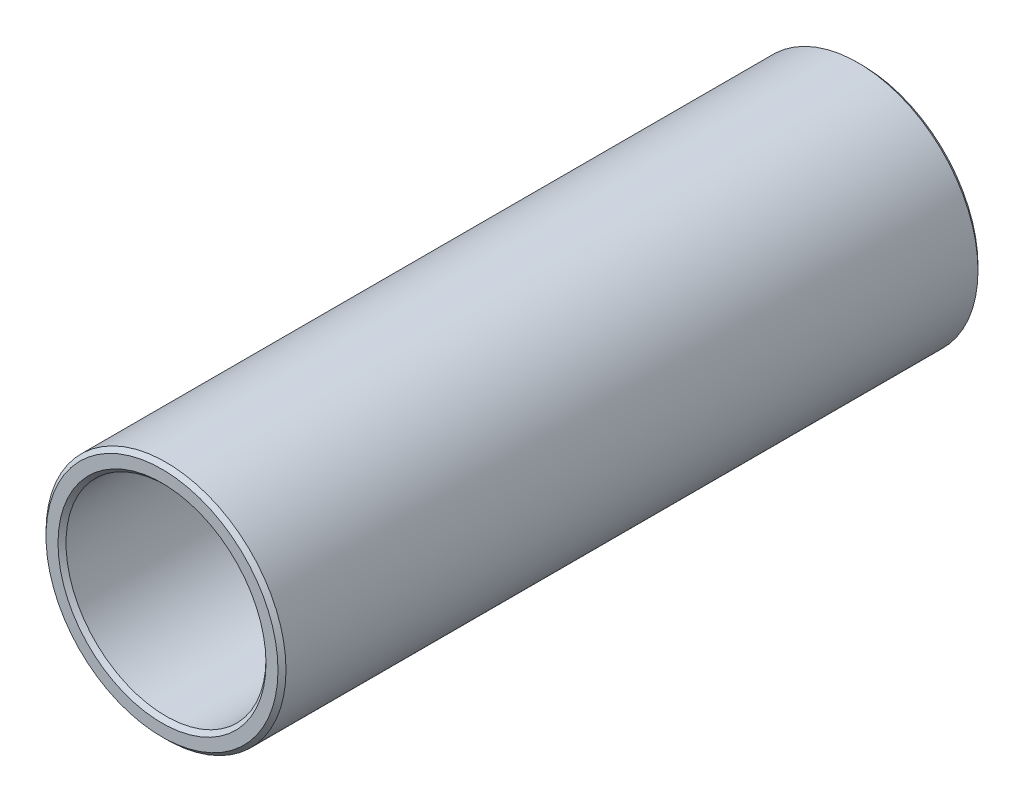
ISO-10303-21;
HEADER;
FILE_DESCRIPTION(('STEP AP214'),'2;1');
FILE_NAME('part.step','',(''),(''),'','','');
FILE_SCHEMA(('AUTOMOTIVE_DESIGN { 1 0 10303 214 1 1 1 1 }'));
ENDSEC;
DATA;
#1=APPLICATION_CONTEXT('core data for automotive mechanical design processes');
#2=APPLICATION_PROTOCOL_DEFINITION('international standard','automotive_design',2000,#1);
#3=PRODUCT_CONTEXT('',#1,'mechanical');
#4=PRODUCT('Part','Part','',(#3));
#5=PRODUCT_RELATED_PRODUCT_CATEGORY('part','',(#4));
#6=PRODUCT_DEFINITION_FORMATION('','',#4);
#7=PRODUCT_DEFINITION_CONTEXT('part definition',#1,'design');
#8=PRODUCT_DEFINITION('design','',#6,#7);
#9=PRODUCT_DEFINITION_SHAPE('','',#8);
#10=(LENGTH_UNIT() NAMED_UNIT(*) SI_UNIT(.MILLI.,.METRE.));
#11=(NAMED_UNIT(*) PLANE_ANGLE_UNIT() SI_UNIT($,.RADIAN.));
#12=(NAMED_UNIT(*) SI_UNIT($,.STERADIAN.) SOLID_ANGLE_UNIT());
#13=UNCERTAINTY_MEASURE_WITH_UNIT(LENGTH_MEASURE(1.E-05),#10,'distance_accuracy_value','');
#14=(GEOMETRIC_REPRESENTATION_CONTEXT(3) GLOBAL_UNCERTAINTY_ASSIGNED_CONTEXT((#13)) GLOBAL_UNIT_ASSIGNED_CONTEXT((#10,
#11,#12)) REPRESENTATION_CONTEXT('',''));
#15=CARTESIAN_POINT('',(0.,0.,0.));
#16=DIRECTION('',(0.,0.,1.));
#17=DIRECTION('',(1.,0.,0.));
#18=AXIS2_PLACEMENT_3D('',#15,#16,#17);
#19=CARTESIAN_POINT('',(0.,0.,35.));
#20=DIRECTION('',(0.,0.,1.));
#21=DIRECTION('',(1.,0.,0.));
#22=AXIS2_PLACEMENT_3D('',#19,#20,#21);
#23=PLANE('',#22);
#24=CARTESIAN_POINT('',(0.,0.,35.));
#25=DIRECTION('',(0.,0.,1.));
#26=DIRECTION('',(1.,0.,0.));
#27=AXIS2_PLACEMENT_3D('',#24,#25,#26);
#28=CIRCLE('',#27,5.2);
#29=CARTESIAN_POINT('',(5.2,0.,35.));
#30=VERTEX_POINT('',#29);
#31=EDGE_CURVE('E42',#30,#30,#28,.F.);
#32=ORIENTED_EDGE('',*,*,#31,.T.);
#33=EDGE_LOOP('',(#32));
#34=FACE_BOUND('',#33,.T.);
#35=CARTESIAN_POINT('',(0.,0.,35.));
#36=DIRECTION('',(0.,0.,1.));
#37=DIRECTION('',(1.,0.,0.));
#38=AXIS2_PLACEMENT_3D('',#35,#36,#37);
#39=CIRCLE('',#38,5.80000000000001);
#40=CARTESIAN_POINT('',(5.80000000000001,0.,35.));
#41=VERTEX_POINT('',#40);
#42=EDGE_CURVE('E46',#41,#41,#39,.T.);
#43=ORIENTED_EDGE('',*,*,#42,.T.);
#44=EDGE_LOOP('',(#43));
#45=FACE_BOUND('',#44,.T.);
#46=ADVANCED_FACE('F31',(#34,#45),#23,.T.);
#47=CARTESIAN_POINT('',(0.,0.,0.));
#48=DIRECTION('',(0.,0.,1.));
#49=DIRECTION('',(1.,0.,0.));
#50=AXIS2_PLACEMENT_3D('',#47,#48,#49);
#51=PLANE('',#50);
#52=CARTESIAN_POINT('',(0.,0.,0.));
#53=DIRECTION('',(0.,0.,1.));
#54=DIRECTION('',(1.,0.,0.));
#55=AXIS2_PLACEMENT_3D('',#52,#53,#54);
#56=CIRCLE('',#55,5.2);
#57=CARTESIAN_POINT('',(5.2,0.,0.));
#58=VERTEX_POINT('',#57);
#59=EDGE_CURVE('E57',#58,#58,#56,.T.);
#60=ORIENTED_EDGE('',*,*,#59,.T.);
#61=EDGE_LOOP('',(#60));
#62=FACE_BOUND('',#61,.T.);
#63=CARTESIAN_POINT('',(0.,0.,0.));
#64=DIRECTION('',(0.,0.,1.));
#65=DIRECTION('',(1.,0.,0.));
#66=AXIS2_PLACEMENT_3D('',#63,#64,#65);
#67=CIRCLE('',#66,5.8);
#68=CARTESIAN_POINT('',(5.8,0.,0.));
#69=VERTEX_POINT('',#68);
#70=EDGE_CURVE('E60',#69,#69,#67,.F.);
#71=ORIENTED_EDGE('',*,*,#70,.T.);
#72=EDGE_LOOP('',(#71));
#73=FACE_BOUND('',#72,.T.);
#74=ADVANCED_FACE('F64',(#62,#73),#51,.F.);
#75=CARTESIAN_POINT('',(0.,0.,35.));
#76=DIRECTION('',(0.,0.,-1.));
#77=DIRECTION('',(-1.,0.,0.));
#78=AXIS2_PLACEMENT_3D('',#75,#76,#77);
#79=CYLINDRICAL_SURFACE('',#78,6.);
#80=CARTESIAN_POINT('',(0.,0.,0.199999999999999));
#81=DIRECTION('',(0.,0.,1.));
#82=DIRECTION('',(1.,0.,0.));
#83=AXIS2_PLACEMENT_3D('',#80,#81,#82);
#84=CIRCLE('',#83,6.);
#85=CARTESIAN_POINT('',(6.,0.,0.199999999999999));
#86=VERTEX_POINT('',#85);
#87=EDGE_CURVE('E10',#86,#86,#84,.T.);
#88=ORIENTED_EDGE('',*,*,#87,.T.);
#89=EDGE_LOOP('',(#88));
#90=FACE_BOUND('',#89,.T.);
#91=CARTESIAN_POINT('',(0.,0.,34.8));
#92=DIRECTION('',(0.,0.,1.));
#93=DIRECTION('',(1.,0.,0.));
#94=AXIS2_PLACEMENT_3D('',#91,#92,#93);
#95=CIRCLE('',#94,6.);
#96=CARTESIAN_POINT('',(6.,0.,34.8));
#97=VERTEX_POINT('',#96);
#98=EDGE_CURVE('E38',#97,#97,#95,.F.);
#99=ORIENTED_EDGE('',*,*,#98,.T.);
#100=EDGE_LOOP('',(#99));
#101=FACE_BOUND('',#100,.T.);
#102=ADVANCED_FACE('F84',(#90,#101),#79,.T.);
#103=CARTESIAN_POINT('',(0.,0.,35.));
#104=DIRECTION('',(0.,0.,-1.));
#105=DIRECTION('',(-1.,0.,0.));
#106=AXIS2_PLACEMENT_3D('',#103,#104,#105);
#107=CYLINDRICAL_SURFACE('',#106,5.);
#108=CARTESIAN_POINT('',(0.,0.,0.200000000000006));
#109=DIRECTION('',(0.,0.,1.));
#110=DIRECTION('',(1.,0.,0.));
#111=AXIS2_PLACEMENT_3D('',#108,#109,#110);
#112=CIRCLE('',#111,5.);
#113=CARTESIAN_POINT('',(5.,0.,0.200000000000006));
#114=VERTEX_POINT('',#113);
#115=EDGE_CURVE('E51',#114,#114,#112,.F.);
#116=ORIENTED_EDGE('',*,*,#115,.T.);
#117=EDGE_LOOP('',(#116));
#118=FACE_BOUND('',#117,.T.);
#119=CARTESIAN_POINT('',(0.,0.,34.8));
#120=DIRECTION('',(0.,0.,1.));
#121=DIRECTION('',(1.,0.,0.));
#122=AXIS2_PLACEMENT_3D('',#119,#120,#121);
#123=CIRCLE('',#122,5.);
#124=CARTESIAN_POINT('',(5.,0.,34.8));
#125=VERTEX_POINT('',#124);
#126=EDGE_CURVE('E54',#125,#125,#123,.T.);
#127=ORIENTED_EDGE('',*,*,#126,.T.);
#128=EDGE_LOOP('',(#127));
#129=FACE_BOUND('',#128,.T.);
#130=ADVANCED_FACE('F89',(#118,#129),#107,.F.);
#131=CARTESIAN_POINT('',(0.,0.,0.));
#132=DIRECTION('',(0.,0.,-1.));
#133=DIRECTION('',(-1.,0.,0.));
#134=AXIS2_PLACEMENT_3D('',#131,#132,#133);
#135=CONICAL_SURFACE('',#134,5.2,0.785398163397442);
#136=ORIENTED_EDGE('',*,*,#115,.F.);
#137=EDGE_LOOP('',(#136));
#138=FACE_BOUND('',#137,.T.);
#139=ORIENTED_EDGE('',*,*,#59,.F.);
#140=EDGE_LOOP('',(#139));
#141=FACE_BOUND('',#140,.T.);
#142=ADVANCED_FACE('F75',(#138,#141),#135,.F.);
#143=CARTESIAN_POINT('',(0.,0.,34.8));
#144=DIRECTION('',(0.,0.,1.));
#145=DIRECTION('',(1.,0.,0.));
#146=AXIS2_PLACEMENT_3D('',#143,#144,#145);
#147=CONICAL_SURFACE('',#146,5.,0.78539816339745);
#148=ORIENTED_EDGE('',*,*,#31,.F.);
#149=EDGE_LOOP('',(#148));
#150=FACE_BOUND('',#149,.T.);
#151=ORIENTED_EDGE('',*,*,#126,.F.);
#152=EDGE_LOOP('',(#151));
#153=FACE_BOUND('',#152,.T.);
#154=ADVANCED_FACE('F69',(#150,#153),#147,.F.);
#155=CARTESIAN_POINT('',(0.,0.,0.199999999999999));
#156=DIRECTION('',(0.,0.,1.));
#157=DIRECTION('',(1.,0.,0.));
#158=AXIS2_PLACEMENT_3D('',#155,#156,#157);
#159=CONICAL_SURFACE('',#158,6.,0.785398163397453);
#160=ORIENTED_EDGE('',*,*,#70,.F.);
#161=EDGE_LOOP('',(#160));
#162=FACE_BOUND('',#161,.T.);
#163=ORIENTED_EDGE('',*,*,#87,.F.);
#164=EDGE_LOOP('',(#163));
#165=FACE_BOUND('',#164,.T.);
#166=ADVANCED_FACE('F66',(#162,#165),#159,.T.);
#167=CARTESIAN_POINT('',(0.,0.,35.));
#168=DIRECTION('',(0.,0.,-1.));
#169=DIRECTION('',(-1.,0.,0.));
#170=AXIS2_PLACEMENT_3D('',#167,#168,#169);
#171=CONICAL_SURFACE('',#170,5.80000000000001,0.78539816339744);
#172=ORIENTED_EDGE('',*,*,#98,.F.);
#173=EDGE_LOOP('',(#172));
#174=FACE_BOUND('',#173,.T.);
#175=ORIENTED_EDGE('',*,*,#42,.F.);
#176=EDGE_LOOP('',(#175));
#177=FACE_BOUND('',#176,.T.);
#178=ADVANCED_FACE('F33',(#174,#177),#171,.T.);
#179=CLOSED_SHELL('',(#46,#74,#102,#130,#142,#154,#166,#178));
#180=MANIFOLD_SOLID_BREP('B2',#179);
#181=ADVANCED_BREP_SHAPE_REPRESENTATION('',(#18,#180),#14);
#182=SHAPE_DEFINITION_REPRESENTATION(#9,#181);
ENDSEC;
END-ISO-10303-21;
